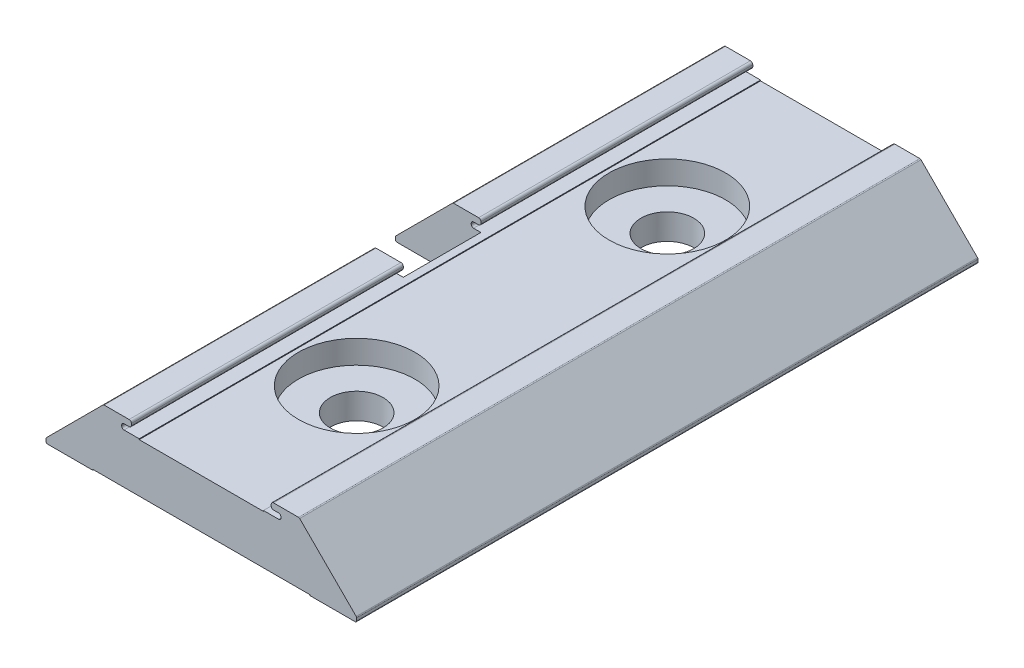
from build123d import *

# Parameters (mm, degrees)
EXTRUDE1_DEPTH                                      = 40
CBORE_FOR_M3_HEX_SOCKET_HEAD_CAP_SCREW1_D           = 3.4
CBORE_FOR_M3_HEX_SOCKET_HEAD_CAP_SCREW1_CBORE_D     = 7.5
CBORE_FOR_M3_HEX_SOCKET_HEAD_CAP_SCREW1_CBORE_DEPTH = 1.5
LPATTERN1_COUNT                                     = 2
LPATTERN1_PITCH                                     = 20
SKETCH6_W                                           = 5
SKETCH6_H                                           = 12.06825605
EXTRUDE2_DEPTH                                      = 5.5
M1_6_TAPPED_HOLE1_D                                 = 1.25
M1_6_TAPPED_HOLE1_DEPTH                             = 6.05
M1_6_TAPPED_HOLE1_TIP                               = 0.375537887


with BuildPart() as part:
    # Sketch1 → Extrude1 (new body)
    with BuildSketch(Plane.XY):
        with BuildLine():
            Line((0.1, 0), (3, 0))
            Line((3, 0), (3, 0.05))
            Line((3, 0.05), (17, 0.05))
            Line((17, 0.05), (17, 0))
            Line((17, 0), (19.9, 0))
            ThreePointArc((19.9, 0), (19.970710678, 0.029289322), (20, 0.1))
            Line((20, 0.1), (20, 0.258578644))
            ThreePointArc((20, 0.258578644), (19.992387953, 0.296846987), (19.970710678, 0.329289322))
            Line((19.970710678, 0.329289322), (16.329289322, 3.970710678))
            ThreePointArc((16.329289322, 3.970710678), (16.296846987, 3.992387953), (16.258578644, 4))
            Line((16.258578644, 4), (14.65, 4))
            ThreePointArc((14.65, 4), (14.543933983, 3.956066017), (14.5, 3.85))
            Line((14.5, 3.85), (14.5, 3.75))
            ThreePointArc((14.5, 3.75), (14.543933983, 3.643933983), (14.65, 3.6))
            Line((14.65, 3.6), (14.975, 3.6))
            ThreePointArc((14.975, 3.6), (15.081066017, 3.556066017), (15.125, 3.45))
            Line((15.125, 3.45), (15.125, 3.4))
            ThreePointArc((15.125, 3.4), (15.081066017, 3.293933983), (14.975, 3.25))
            Line((14.975, 3.25), (14, 3.25))
            Line((14, 3.25), (14, 3.2))
            Line((14, 3.2), (9.9, 3.2))
            Line((9.9, 3.2), (6, 3.2))
            Line((6, 3.2), (6, 3.25))
            Line((6, 3.25), (5.025, 3.25))
            ThreePointArc((5.025, 3.25), (4.918933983, 3.293933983), (4.875, 3.4))
            Line((4.875, 3.4), (4.875, 3.45))
            ThreePointArc((4.875, 3.45), (4.918933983, 3.556066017), (5.025, 3.6))
            Line((5.025, 3.6), (5.35, 3.6))
            ThreePointArc((5.35, 3.6), (5.456066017, 3.643933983), (5.5, 3.75))
            Line((5.5, 3.75), (5.5, 3.85))
            ThreePointArc((5.5, 3.85), (5.456066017, 3.956066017), (5.35, 4))
            Line((5.35, 4), (3.741421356, 4))
            ThreePointArc((3.741421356, 4), (3.703153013, 3.992387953), (3.670710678, 3.970710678))
            Line((3.670710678, 3.970710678), (0.029289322, 0.329289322))
            ThreePointArc((0.029289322, 0.329289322), (0.007612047, 0.296846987), (0, 0.258578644))
            Line((0, 0.258578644), (0, 0.1))
            ThreePointArc((0, 0.1), (0.029289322, 0.029289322), (0.1, 0))
        make_face()
    extrude(amount=EXTRUDE1_DEPTH)

    # CBORE for M3 Hex Socket Head Cap Screw1 (through all)
    with Locations(Plane(origin=(0, 3.2, 0), x_dir=(-1, 0, 0), z_dir=(0, 1, 0))):
        with Locations((-10, 10)):
            cbore_for_m3_hex_socket_head_cap_screw1 = CounterBoreHole(CBORE_FOR_M3_HEX_SOCKET_HEAD_CAP_SCREW1_D / 2, CBORE_FOR_M3_HEX_SOCKET_HEAD_CAP_SCREW1_CBORE_D / 2, CBORE_FOR_M3_HEX_SOCKET_HEAD_CAP_SCREW1_CBORE_DEPTH)

    # LPattern1: CBORE for M3 Hex Socket Head Cap Screw1 ×2
    with Locations(*[(0, 0, i * LPATTERN1_PITCH) for i in range(1, LPATTERN1_COUNT)]):
        add(cbore_for_m3_hex_socket_head_cap_screw1, mode=Mode.SUBTRACT)

    # Sketch6 → Extrude2 (cut)
    with BuildSketch(Plane.ZY):
        with Locations((20, 1.798862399)):
            Rectangle(SKETCH6_W, SKETCH6_H)
    extrude(amount=-EXTRUDE2_DEPTH, mode=Mode.SUBTRACT)

    # M1.6 Tapped Hole1
    with Locations(Plane.ZY.offset(-5.5)):
        with Locations((20, 1.75)):
            Hole(M1_6_TAPPED_HOLE1_D / 2, depth=M1_6_TAPPED_HOLE1_DEPTH)
            with Locations((0, 0, -(M1_6_TAPPED_HOLE1_DEPTH + M1_6_TAPPED_HOLE1_TIP / 2))):  # 118° drill point
                Cone(0, M1_6_TAPPED_HOLE1_D / 2, M1_6_TAPPED_HOLE1_TIP, mode=Mode.SUBTRACT)


solid = part.part
